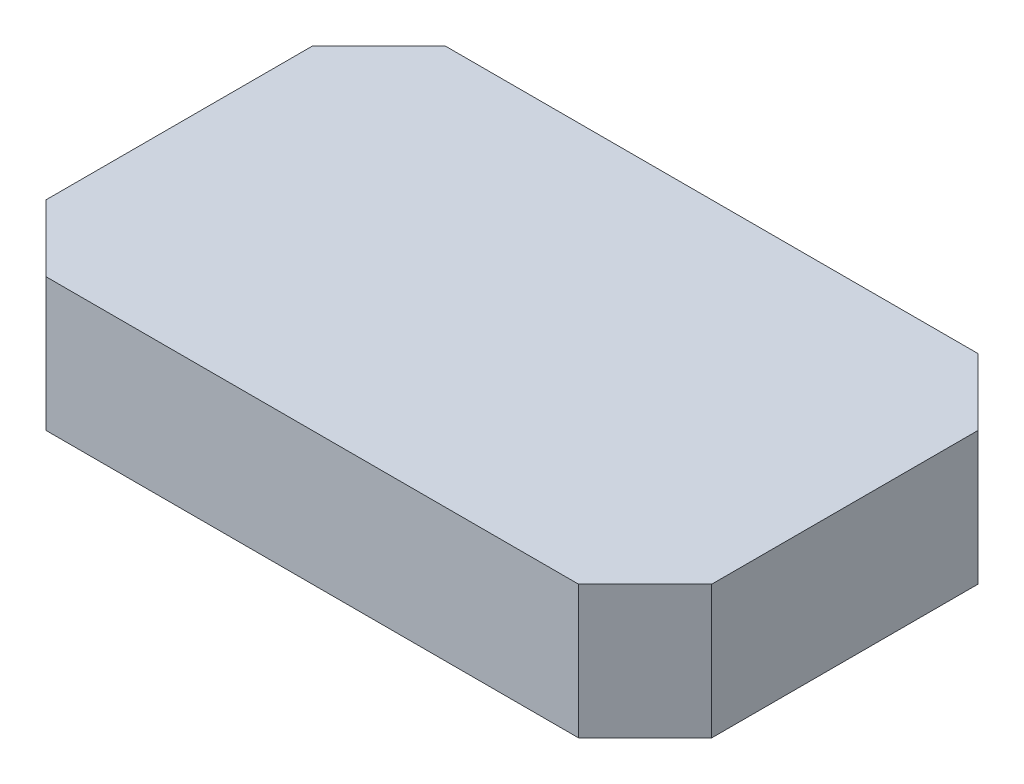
from build123d import *

# Parameters (mm, degrees)
SKETCH_1_W      = 50
SKETCH_1_H      = 30
EXTRUDE_1_DEPTH = 10
CHAMFER_2_SIZE  = 5


with BuildPart() as part:
    # Sketch 1 → Extrude 1 (new body)
    with BuildSketch(Plane(origin=(0, 0, 0), x_dir=(1, 0, 0), z_dir=(0, 1, 0))):
        Rectangle(SKETCH_1_W, SKETCH_1_H)
    extrude(amount=EXTRUDE_1_DEPTH)

    # Chamfer 2
    chamfer_2_edges = [part.edges().sort_by_distance(p)[0] for p in [
        (25, 5, 15),
        (-25, 5, 15),
        (-25, 5, -15),
        (25, 5, -15),
    ]]
    chamfer(chamfer_2_edges, length=CHAMFER_2_SIZE)


solid = part.part
